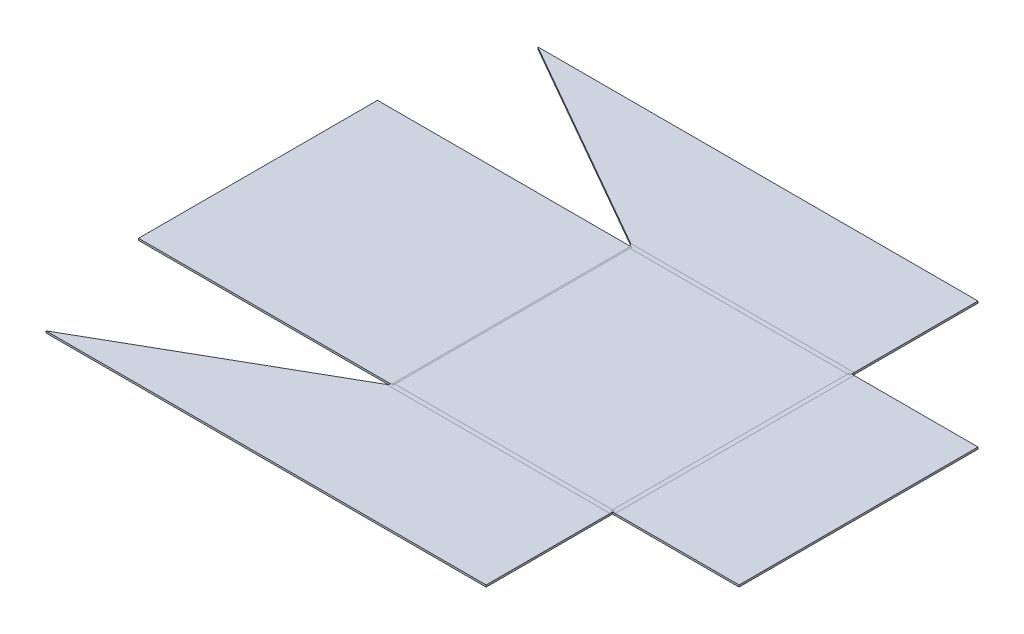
ISO-10303-21;
HEADER;
FILE_DESCRIPTION(('STEP AP214'),'2;1');
FILE_NAME('part.step','',(''),(''),'','','');
FILE_SCHEMA(('AUTOMOTIVE_DESIGN { 1 0 10303 214 1 1 1 1 }'));
ENDSEC;
DATA;
#1=APPLICATION_CONTEXT('core data for automotive mechanical design processes');
#2=APPLICATION_PROTOCOL_DEFINITION('international standard','automotive_design',2000,#1);
#3=PRODUCT_CONTEXT('',#1,'mechanical');
#4=PRODUCT('Part','Part','',(#3));
#5=PRODUCT_RELATED_PRODUCT_CATEGORY('part','',(#4));
#6=PRODUCT_DEFINITION_FORMATION('','',#4);
#7=PRODUCT_DEFINITION_CONTEXT('part definition',#1,'design');
#8=PRODUCT_DEFINITION('design','',#6,#7);
#9=PRODUCT_DEFINITION_SHAPE('','',#8);
#10=(LENGTH_UNIT() NAMED_UNIT(*) SI_UNIT(.MILLI.,.METRE.));
#11=(NAMED_UNIT(*) PLANE_ANGLE_UNIT() SI_UNIT($,.RADIAN.));
#12=(NAMED_UNIT(*) SI_UNIT($,.STERADIAN.) SOLID_ANGLE_UNIT());
#13=UNCERTAINTY_MEASURE_WITH_UNIT(LENGTH_MEASURE(1.E-05),#10,'distance_accuracy_value','');
#14=(GEOMETRIC_REPRESENTATION_CONTEXT(3) GLOBAL_UNCERTAINTY_ASSIGNED_CONTEXT((#13)) GLOBAL_UNIT_ASSIGNED_CONTEXT((#10,
#11,#12)) REPRESENTATION_CONTEXT('',''));
#15=CARTESIAN_POINT('',(0.,0.,0.));
#16=DIRECTION('',(0.,0.,1.));
#17=DIRECTION('',(1.,0.,0.));
#18=AXIS2_PLACEMENT_3D('',#15,#16,#17);
#19=CARTESIAN_POINT('',(350.,203.,190.));
#20=DIRECTION('',(0.,-1.,0.));
#21=DIRECTION('',(1.,0.,0.));
#22=AXIS2_PLACEMENT_3D('',#19,#20,#21);
#23=PLANE('',#22);
#24=DIRECTION('',(0.,0.,-1.));
#25=VECTOR('',#24,1.);
#26=CARTESIAN_POINT('',(0.796693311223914,203.,189.99));
#27=LINE('',#26,#25);
#28=CARTESIAN_POINT('',(0.796693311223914,203.,187.));
#29=VERTEX_POINT('',#28);
#30=CARTESIAN_POINT('',(0.796693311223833,203.,-187.));
#31=VERTEX_POINT('',#30);
#32=EDGE_CURVE('E1153',#29,#31,#27,.T.);
#33=ORIENTED_EDGE('',*,*,#32,.F.);
#34=DIRECTION('',(-1.,0.,0.));
#35=VECTOR('',#34,1.);
#36=CARTESIAN_POINT('',(349.99,203.,187.));
#37=LINE('',#36,#35);
#38=CARTESIAN_POINT('',(347.,203.,187.));
#39=VERTEX_POINT('',#38);
#40=EDGE_CURVE('E11',#39,#29,#37,.T.);
#41=ORIENTED_EDGE('',*,*,#40,.F.);
#42=DIRECTION('',(0.,0.,1.));
#43=VECTOR('',#42,1.);
#44=CARTESIAN_POINT('',(347.,203.,-189.99));
#45=LINE('',#44,#43);
#46=CARTESIAN_POINT('',(347.,203.,-187.));
#47=VERTEX_POINT('',#46);
#48=EDGE_CURVE('E1149',#47,#39,#45,.T.);
#49=ORIENTED_EDGE('',*,*,#48,.F.);
#50=DIRECTION('',(1.,0.,0.));
#51=VECTOR('',#50,1.);
#52=CARTESIAN_POINT('',(0.0201556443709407,203.,-187.));
#53=LINE('',#52,#51);
#54=EDGE_CURVE('E793',#31,#47,#53,.T.);
#55=ORIENTED_EDGE('',*,*,#54,.F.);
#56=EDGE_LOOP('',(#33,#41,#49,#55));
#57=FACE_BOUND('',#56,.T.);
#58=ADVANCED_FACE('F770',(#57),#23,.F.);
#59=CARTESIAN_POINT('',(351.068583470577,-653.022897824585,-189.99));
#60=DIRECTION('',(0.,0.,1.));
#61=DIRECTION('',(1.,0.,0.));
#62=AXIS2_PLACEMENT_3D('',#59,#60,#61);
#63=PLANE('',#62);
#64=DIRECTION('',(0.,1.,0.));
#65=VECTOR('',#64,1.);
#66=CARTESIAN_POINT('',(354.068583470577,-653.022897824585,-189.99));
#67=LINE('',#66,#65);
#68=CARTESIAN_POINT('',(354.068583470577,200.,-189.99));
#69=VERTEX_POINT('',#68);
#70=CARTESIAN_POINT('',(354.068583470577,203.,-189.99));
#71=VERTEX_POINT('',#70);
#72=EDGE_CURVE('E1141',#69,#71,#67,.T.);
#73=ORIENTED_EDGE('',*,*,#72,.T.);
#74=DIRECTION('',(1.,0.,0.));
#75=VECTOR('',#74,1.);
#76=CARTESIAN_POINT('',(348.068583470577,203.,-189.99));
#77=LINE('',#76,#75);
#78=CARTESIAN_POINT('',(551.068583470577,203.,-189.99));
#79=VERTEX_POINT('',#78);
#80=EDGE_CURVE('E1118',#71,#79,#77,.T.);
#81=ORIENTED_EDGE('',*,*,#80,.T.);
#82=DIRECTION('',(0.,1.,0.));
#83=VECTOR('',#82,1.);
#84=CARTESIAN_POINT('',(551.068583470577,-653.022897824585,-189.99));
#85=LINE('',#84,#83);
#86=CARTESIAN_POINT('',(551.068583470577,200.,-189.99));
#87=VERTEX_POINT('',#86);
#88=EDGE_CURVE('E1138',#87,#79,#85,.T.);
#89=ORIENTED_EDGE('',*,*,#88,.F.);
#90=DIRECTION('',(1.,0.,0.));
#91=VECTOR('',#90,1.);
#92=CARTESIAN_POINT('',(351.068583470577,200.,-189.99));
#93=LINE('',#92,#91);
#94=EDGE_CURVE('E1125',#69,#87,#93,.T.);
#95=ORIENTED_EDGE('',*,*,#94,.F.);
#96=EDGE_LOOP('',(#73,#81,#89,#95));
#97=FACE_BOUND('',#96,.T.);
#98=ADVANCED_FACE('F1376',(#97),#63,.F.);
#99=CARTESIAN_POINT('',(551.068583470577,-653.022897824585,190.));
#100=DIRECTION('',(1.,0.,0.));
#101=DIRECTION('',(0.,1.,0.));
#102=AXIS2_PLACEMENT_3D('',#99,#100,#101);
#103=PLANE('',#102);
#104=DIRECTION('',(0.,0.,-1.));
#105=VECTOR('',#104,1.);
#106=CARTESIAN_POINT('',(551.068583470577,203.,190.));
#107=LINE('',#106,#105);
#108=CARTESIAN_POINT('',(551.068583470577,203.,189.99));
#109=VERTEX_POINT('',#108);
#110=EDGE_CURVE('E1120',#109,#79,#107,.T.);
#111=ORIENTED_EDGE('',*,*,#110,.F.);
#112=DIRECTION('',(0.,1.,0.));
#113=VECTOR('',#112,1.);
#114=CARTESIAN_POINT('',(551.068583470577,-653.022897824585,189.99));
#115=LINE('',#114,#113);
#116=CARTESIAN_POINT('',(551.068583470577,200.,189.99));
#117=VERTEX_POINT('',#116);
#118=EDGE_CURVE('E1136',#117,#109,#115,.T.);
#119=ORIENTED_EDGE('',*,*,#118,.F.);
#120=DIRECTION('',(0.,0.,-1.));
#121=VECTOR('',#120,1.);
#122=CARTESIAN_POINT('',(551.068583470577,200.,190.));
#123=LINE('',#122,#121);
#124=EDGE_CURVE('E1127',#117,#87,#123,.T.);
#125=ORIENTED_EDGE('',*,*,#124,.T.);
#126=ORIENTED_EDGE('',*,*,#88,.T.);
#127=EDGE_LOOP('',(#111,#119,#125,#126));
#128=FACE_BOUND('',#127,.T.);
#129=ADVANCED_FACE('F1380',(#128),#103,.T.);
#130=CARTESIAN_POINT('',(351.068583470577,-653.022897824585,189.99));
#131=DIRECTION('',(0.,0.,1.));
#132=DIRECTION('',(1.,0.,0.));
#133=AXIS2_PLACEMENT_3D('',#130,#131,#132);
#134=PLANE('',#133);
#135=DIRECTION('',(1.,0.,0.));
#136=VECTOR('',#135,1.);
#137=CARTESIAN_POINT('',(351.068583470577,203.,189.99));
#138=LINE('',#137,#136);
#139=CARTESIAN_POINT('',(354.068583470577,203.,189.99));
#140=VERTEX_POINT('',#139);
#141=EDGE_CURVE('E1146',#140,#109,#138,.T.);
#142=ORIENTED_EDGE('',*,*,#141,.F.);
#143=DIRECTION('',(0.,1.,0.));
#144=VECTOR('',#143,1.);
#145=CARTESIAN_POINT('',(354.068583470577,-653.022897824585,189.99));
#146=LINE('',#145,#144);
#147=CARTESIAN_POINT('',(354.068583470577,200.,189.99));
#148=VERTEX_POINT('',#147);
#149=EDGE_CURVE('E1133',#148,#140,#146,.T.);
#150=ORIENTED_EDGE('',*,*,#149,.F.);
#151=DIRECTION('',(1.,0.,0.));
#152=VECTOR('',#151,1.);
#153=CARTESIAN_POINT('',(351.068583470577,200.,189.99));
#154=LINE('',#153,#152);
#155=EDGE_CURVE('E1143',#148,#117,#154,.T.);
#156=ORIENTED_EDGE('',*,*,#155,.T.);
#157=ORIENTED_EDGE('',*,*,#118,.T.);
#158=EDGE_LOOP('',(#142,#150,#156,#157));
#159=FACE_BOUND('',#158,.T.);
#160=ADVANCED_FACE('F1334',(#159),#134,.T.);
#161=CARTESIAN_POINT('',(551.068583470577,200.,190.));
#162=DIRECTION('',(0.,-1.,0.));
#163=DIRECTION('',(0.,0.,1.));
#164=AXIS2_PLACEMENT_3D('',#161,#162,#163);
#165=PLANE('',#164);
#166=DIRECTION('',(0.,0.,1.));
#167=VECTOR('',#166,1.);
#168=CARTESIAN_POINT('',(354.068583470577,200.,-189.99));
#169=LINE('',#168,#167);
#170=EDGE_CURVE('E1130',#69,#148,#169,.T.);
#171=ORIENTED_EDGE('',*,*,#170,.F.);
#172=ORIENTED_EDGE('',*,*,#94,.T.);
#173=ORIENTED_EDGE('',*,*,#124,.F.);
#174=ORIENTED_EDGE('',*,*,#155,.F.);
#175=EDGE_LOOP('',(#171,#172,#173,#174));
#176=FACE_BOUND('',#175,.T.);
#177=ADVANCED_FACE('F1388',(#176),#165,.T.);
#178=CARTESIAN_POINT('',(551.068583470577,203.,190.));
#179=DIRECTION('',(0.,-1.,0.));
#180=DIRECTION('',(0.,0.,1.));
#181=AXIS2_PLACEMENT_3D('',#178,#179,#180);
#182=PLANE('',#181);
#183=ORIENTED_EDGE('',*,*,#80,.F.);
#184=DIRECTION('',(0.,0.,1.));
#185=VECTOR('',#184,1.);
#186=CARTESIAN_POINT('',(354.068583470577,203.,-189.99));
#187=LINE('',#186,#185);
#188=EDGE_CURVE('E1123',#71,#140,#187,.T.);
#189=ORIENTED_EDGE('',*,*,#188,.T.);
#190=ORIENTED_EDGE('',*,*,#141,.T.);
#191=ORIENTED_EDGE('',*,*,#110,.T.);
#192=EDGE_LOOP('',(#183,#189,#190,#191));
#193=FACE_BOUND('',#192,.T.);
#194=ADVANCED_FACE('F1339',(#193),#182,.F.);
#195=CARTESIAN_POINT('',(-0.742770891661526,200.,190.));
#196=DIRECTION('',(0.,-1.,0.));
#197=DIRECTION('',(1.,0.,0.));
#198=AXIS2_PLACEMENT_3D('',#195,#196,#197);
#199=PLANE('',#198);
#200=DIRECTION('',(-1.,0.,0.));
#201=VECTOR('',#200,1.);
#202=CARTESIAN_POINT('',(-0.742770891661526,200.,189.99));
#203=LINE('',#202,#201);
#204=CARTESIAN_POINT('',(-1.53946420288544,200.,189.99));
#205=VERTEX_POINT('',#204);
#206=CARTESIAN_POINT('',(-2.20058632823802,200.,189.99));
#207=VERTEX_POINT('',#206);
#208=EDGE_CURVE('E1084',#205,#207,#203,.T.);
#209=ORIENTED_EDGE('',*,*,#208,.T.);
#210=DIRECTION('',(0.596254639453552,0.,-0.802795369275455));
#211=VECTOR('',#210,1.);
#212=CARTESIAN_POINT('',(-1.68709107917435,200.,189.298631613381));
#213=LINE('',#212,#211);
#214=CARTESIAN_POINT('',(-1.53946420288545,200.,189.099867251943));
#215=VERTEX_POINT('',#214);
#216=EDGE_CURVE('E1115',#207,#215,#213,.T.);
#217=ORIENTED_EDGE('',*,*,#216,.T.);
#218=DIRECTION('',(0.,0.,-1.));
#219=VECTOR('',#218,1.);
#220=CARTESIAN_POINT('',(-1.53946420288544,200.,189.99));
#221=LINE('',#220,#219);
#222=EDGE_CURVE('E1090',#205,#215,#221,.T.);
#223=ORIENTED_EDGE('',*,*,#222,.F.);
#224=EDGE_LOOP('',(#209,#217,#223));
#225=FACE_BOUND('',#224,.T.);
#226=ADVANCED_FACE('F1394',(#225),#199,.T.);
#227=DIRECTION('',(0.,0.,1.));
#228=VECTOR('',#227,1.);
#229=CARTESIAN_POINT('',(-1.53946420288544,200.,-189.99));
#230=LINE('',#229,#228);
#231=CARTESIAN_POINT('',(-1.53946420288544,200.,-189.99));
#232=VERTEX_POINT('',#231);
#233=CARTESIAN_POINT('',(-1.5394642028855,200.,-189.099867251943));
#234=VERTEX_POINT('',#233);
#235=EDGE_CURVE('E1278',#232,#234,#230,.T.);
#236=ORIENTED_EDGE('',*,*,#235,.T.);
#237=DIRECTION('',(-0.596254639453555,0.,-0.802795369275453));
#238=VECTOR('',#237,1.);
#239=CARTESIAN_POINT('',(180.207685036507,200.,55.6039222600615));
#240=LINE('',#239,#238);
#241=CARTESIAN_POINT('',(-2.20058632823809,200.,-189.99));
#242=VERTEX_POINT('',#241);
#243=EDGE_CURVE('E1112',#234,#242,#240,.T.);
#244=ORIENTED_EDGE('',*,*,#243,.T.);
#245=DIRECTION('',(-1.,0.,0.));
#246=VECTOR('',#245,1.);
#247=CARTESIAN_POINT('',(-0.742770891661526,200.,-189.99));
#248=LINE('',#247,#246);
#249=EDGE_CURVE('E1100',#232,#242,#248,.T.);
#250=ORIENTED_EDGE('',*,*,#249,.F.);
#251=EDGE_LOOP('',(#236,#244,#250));
#252=FACE_BOUND('',#251,.T.);
#253=ADVANCED_FACE('F1413',(#252),#199,.T.);
#254=CARTESIAN_POINT('',(-0.742770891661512,203.,190.));
#255=DIRECTION('',(0.,-1.,0.));
#256=DIRECTION('',(1.,0.,0.));
#257=AXIS2_PLACEMENT_3D('',#254,#255,#256);
#258=PLANE('',#257);
#259=DIRECTION('',(0.596254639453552,0.,-0.802795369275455));
#260=VECTOR('',#259,1.);
#261=CARTESIAN_POINT('',(-1.68709107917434,203.,189.298631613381));
#262=LINE('',#261,#260);
#263=CARTESIAN_POINT('',(-2.20058632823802,203.,189.99));
#264=VERTEX_POINT('',#263);
#265=CARTESIAN_POINT('',(-1.53946420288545,203.,189.099867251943));
#266=VERTEX_POINT('',#265);
#267=EDGE_CURVE('E1109',#264,#266,#262,.T.);
#268=ORIENTED_EDGE('',*,*,#267,.F.);
#269=DIRECTION('',(-1.,0.,0.));
#270=VECTOR('',#269,1.);
#271=CARTESIAN_POINT('',(0.0539224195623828,203.,189.99));
#272=LINE('',#271,#270);
#273=CARTESIAN_POINT('',(-1.53946420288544,203.,189.99));
#274=VERTEX_POINT('',#273);
#275=EDGE_CURVE('E1075',#274,#264,#272,.T.);
#276=ORIENTED_EDGE('',*,*,#275,.F.);
#277=DIRECTION('',(0.,0.,-1.));
#278=VECTOR('',#277,1.);
#279=CARTESIAN_POINT('',(-1.53946420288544,203.,189.99));
#280=LINE('',#279,#278);
#281=EDGE_CURVE('E1080',#274,#266,#280,.T.);
#282=ORIENTED_EDGE('',*,*,#281,.T.);
#283=EDGE_LOOP('',(#268,#276,#282));
#284=FACE_BOUND('',#283,.T.);
#285=ADVANCED_FACE('F1417',(#284),#258,.F.);
#286=DIRECTION('',(-0.596254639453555,0.,-0.802795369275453));
#287=VECTOR('',#286,1.);
#288=CARTESIAN_POINT('',(180.207685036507,203.,55.6039222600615));
#289=LINE('',#288,#287);
#290=CARTESIAN_POINT('',(-1.53946420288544,203.,-189.099867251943));
#291=VERTEX_POINT('',#290);
#292=CARTESIAN_POINT('',(-2.200586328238,203.,-189.99));
#293=VERTEX_POINT('',#292);
#294=EDGE_CURVE('E1106',#291,#293,#289,.T.);
#295=ORIENTED_EDGE('',*,*,#294,.F.);
#296=DIRECTION('',(0.,0.,1.));
#297=VECTOR('',#296,1.);
#298=CARTESIAN_POINT('',(-1.53946420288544,203.,-189.99));
#299=LINE('',#298,#297);
#300=CARTESIAN_POINT('',(-1.53946420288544,203.,-189.99));
#301=VERTEX_POINT('',#300);
#302=EDGE_CURVE('E1269',#301,#291,#299,.T.);
#303=ORIENTED_EDGE('',*,*,#302,.F.);
#304=DIRECTION('',(-1.,0.,0.));
#305=VECTOR('',#304,1.);
#306=CARTESIAN_POINT('',(-0.742770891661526,203.,-189.99));
#307=LINE('',#306,#305);
#308=EDGE_CURVE('E1103',#301,#293,#307,.T.);
#309=ORIENTED_EDGE('',*,*,#308,.T.);
#310=EDGE_LOOP('',(#295,#303,#309));
#311=FACE_BOUND('',#310,.T.);
#312=ADVANCED_FACE('F1399',(#311),#258,.F.);
#313=CARTESIAN_POINT('',(-0.742770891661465,-903.784749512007,189.99));
#314=DIRECTION('',(0.,0.,-1.));
#315=DIRECTION('',(-1.,0.,0.));
#316=AXIS2_PLACEMENT_3D('',#313,#314,#315);
#317=PLANE('',#316);
#318=CARTESIAN_POINT('',(-403.855658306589,200.,189.99));
#319=VERTEX_POINT('',#318);
#320=EDGE_CURVE('E1083',#207,#319,#203,.T.);
#321=ORIENTED_EDGE('',*,*,#320,.F.);
#322=DIRECTION('',(0.,1.,0.));
#323=VECTOR('',#322,1.);
#324=CARTESIAN_POINT('',(-2.20058632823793,-903.784749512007,189.99));
#325=LINE('',#324,#323);
#326=EDGE_CURVE('E1071',#207,#264,#325,.T.);
#327=ORIENTED_EDGE('',*,*,#326,.T.);
#328=CARTESIAN_POINT('',(-403.855658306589,203.,189.99));
#329=VERTEX_POINT('',#328);
#330=EDGE_CURVE('E1074',#264,#329,#272,.T.);
#331=ORIENTED_EDGE('',*,*,#330,.T.);
#332=DIRECTION('',(0.,1.,0.));
#333=VECTOR('',#332,1.);
#334=CARTESIAN_POINT('',(-403.855658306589,-903.784749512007,189.99));
#335=LINE('',#334,#333);
#336=EDGE_CURVE('E1096',#319,#329,#335,.T.);
#337=ORIENTED_EDGE('',*,*,#336,.F.);
#338=EDGE_LOOP('',(#321,#327,#331,#337));
#339=FACE_BOUND('',#338,.T.);
#340=ADVANCED_FACE('F1395',(#339),#317,.F.);
#341=CARTESIAN_POINT('',(-403.855658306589,-903.784749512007,190.));
#342=DIRECTION('',(1.,0.,0.));
#343=DIRECTION('',(0.,1.,0.));
#344=AXIS2_PLACEMENT_3D('',#341,#342,#343);
#345=PLANE('',#344);
#346=ORIENTED_EDGE('',*,*,#336,.T.);
#347=DIRECTION('',(0.,0.,-1.));
#348=VECTOR('',#347,1.);
#349=CARTESIAN_POINT('',(-403.855658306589,203.,190.));
#350=LINE('',#349,#348);
#351=CARTESIAN_POINT('',(-403.855658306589,203.,-189.99));
#352=VERTEX_POINT('',#351);
#353=EDGE_CURVE('E1077',#329,#352,#350,.T.);
#354=ORIENTED_EDGE('',*,*,#353,.T.);
#355=DIRECTION('',(0.,1.,0.));
#356=VECTOR('',#355,1.);
#357=CARTESIAN_POINT('',(-403.855658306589,-903.784749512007,-189.99));
#358=LINE('',#357,#356);
#359=CARTESIAN_POINT('',(-403.855658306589,200.,-189.99));
#360=VERTEX_POINT('',#359);
#361=EDGE_CURVE('E1093',#360,#352,#358,.T.);
#362=ORIENTED_EDGE('',*,*,#361,.F.);
#363=DIRECTION('',(0.,0.,-1.));
#364=VECTOR('',#363,1.);
#365=CARTESIAN_POINT('',(-403.855658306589,200.,190.));
#366=LINE('',#365,#364);
#367=EDGE_CURVE('E1087',#319,#360,#366,.T.);
#368=ORIENTED_EDGE('',*,*,#367,.F.);
#369=EDGE_LOOP('',(#346,#354,#362,#368));
#370=FACE_BOUND('',#369,.T.);
#371=ADVANCED_FACE('F1398',(#370),#345,.F.);
#372=CARTESIAN_POINT('',(-0.742770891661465,-903.784749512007,-189.99));
#373=DIRECTION('',(0.,0.,-1.));
#374=DIRECTION('',(-1.,0.,0.));
#375=AXIS2_PLACEMENT_3D('',#372,#373,#374);
#376=PLANE('',#375);
#377=DIRECTION('',(0.,1.,0.));
#378=VECTOR('',#377,1.);
#379=CARTESIAN_POINT('',(-2.20058632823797,-903.784749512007,-189.99));
#380=LINE('',#379,#378);
#381=EDGE_CURVE('E1069',#242,#293,#380,.T.);
#382=ORIENTED_EDGE('',*,*,#381,.F.);
#383=EDGE_CURVE('E1099',#242,#360,#248,.T.);
#384=ORIENTED_EDGE('',*,*,#383,.T.);
#385=ORIENTED_EDGE('',*,*,#361,.T.);
#386=EDGE_CURVE('E1102',#293,#352,#307,.T.);
#387=ORIENTED_EDGE('',*,*,#386,.F.);
#388=EDGE_LOOP('',(#382,#384,#385,#387));
#389=FACE_BOUND('',#388,.T.);
#390=ADVANCED_FACE('F1403',(#389),#376,.T.);
#391=ORIENTED_EDGE('',*,*,#216,.F.);
#392=ORIENTED_EDGE('',*,*,#320,.T.);
#393=ORIENTED_EDGE('',*,*,#367,.T.);
#394=ORIENTED_EDGE('',*,*,#383,.F.);
#395=ORIENTED_EDGE('',*,*,#243,.F.);
#396=EDGE_CURVE('E1277',#234,#215,#230,.T.);
#397=ORIENTED_EDGE('',*,*,#396,.T.);
#398=EDGE_LOOP('',(#391,#392,#393,#394,#395,#397));
#399=FACE_BOUND('',#398,.T.);
#400=ADVANCED_FACE('F1407',(#399),#199,.T.);
#401=ORIENTED_EDGE('',*,*,#330,.F.);
#402=ORIENTED_EDGE('',*,*,#267,.T.);
#403=EDGE_CURVE('E1268',#291,#266,#299,.T.);
#404=ORIENTED_EDGE('',*,*,#403,.F.);
#405=ORIENTED_EDGE('',*,*,#294,.T.);
#406=ORIENTED_EDGE('',*,*,#386,.T.);
#407=ORIENTED_EDGE('',*,*,#353,.F.);
#408=EDGE_LOOP('',(#401,#402,#404,#405,#406,#407));
#409=FACE_BOUND('',#408,.T.);
#410=ADVANCED_FACE('F1411',(#409),#258,.F.);
#411=CARTESIAN_POINT('',(349.99,200.,194.068583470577));
#412=DIRECTION('',(0.,-1.,0.));
#413=DIRECTION('',(1.,0.,0.));
#414=AXIS2_PLACEMENT_3D('',#411,#412,#413);
#415=PLANE('',#414);
#416=ORIENTED_EDGE('',*,*,#208,.F.);
#417=DIRECTION('',(1.,0.,0.));
#418=VECTOR('',#417,1.);
#419=CARTESIAN_POINT('',(-1.53946420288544,200.,189.99));
#420=LINE('',#419,#418);
#421=CARTESIAN_POINT('',(0.796693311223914,200.,189.99));
#422=VERTEX_POINT('',#421);
#423=EDGE_CURVE('E1271',#205,#422,#420,.T.);
#424=ORIENTED_EDGE('',*,*,#423,.T.);
#425=DIRECTION('',(0.,0.,-1.));
#426=VECTOR('',#425,1.);
#427=CARTESIAN_POINT('',(0.796693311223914,200.,189.99));
#428=LINE('',#427,#426);
#429=CARTESIAN_POINT('',(0.796693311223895,200.,187.));
#430=VERTEX_POINT('',#429);
#431=EDGE_CURVE('E1171',#422,#430,#428,.T.);
#432=ORIENTED_EDGE('',*,*,#431,.T.);
#433=DIRECTION('',(-1.,0.,0.));
#434=VECTOR('',#433,1.);
#435=CARTESIAN_POINT('',(349.99,200.,187.));
#436=LINE('',#435,#434);
#437=CARTESIAN_POINT('',(347.,200.,187.));
#438=VERTEX_POINT('',#437);
#439=EDGE_CURVE('E778',#438,#430,#436,.T.);
#440=ORIENTED_EDGE('',*,*,#439,.F.);
#441=DIRECTION('',(0.,0.,1.));
#442=VECTOR('',#441,1.);
#443=CARTESIAN_POINT('',(347.,200.,-189.99));
#444=LINE('',#443,#442);
#445=CARTESIAN_POINT('',(347.,200.,189.99));
#446=VERTEX_POINT('',#445);
#447=EDGE_CURVE('E1168',#438,#446,#444,.T.);
#448=ORIENTED_EDGE('',*,*,#447,.T.);
#449=DIRECTION('',(1.,0.,0.));
#450=VECTOR('',#449,1.);
#451=CARTESIAN_POINT('',(347.,200.,189.99));
#452=LINE('',#451,#450);
#453=CARTESIAN_POINT('',(349.99,200.,189.99));
#454=VERTEX_POINT('',#453);
#455=EDGE_CURVE('E1184',#446,#454,#452,.T.);
#456=ORIENTED_EDGE('',*,*,#455,.T.);
#457=DIRECTION('',(0.,0.,-1.));
#458=VECTOR('',#457,1.);
#459=CARTESIAN_POINT('',(349.99,200.,194.068583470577));
#460=LINE('',#459,#458);
#461=CARTESIAN_POINT('',(349.99,200.,194.068583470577));
#462=VERTEX_POINT('',#461);
#463=EDGE_CURVE('E1253',#462,#454,#460,.T.);
#464=ORIENTED_EDGE('',*,*,#463,.F.);
#465=DIRECTION('',(-1.,0.,0.));
#466=VECTOR('',#465,1.);
#467=CARTESIAN_POINT('',(349.99,200.,194.068583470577));
#468=LINE('',#467,#466);
#469=CARTESIAN_POINT('',(-5.22984435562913,200.,194.068583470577));
#470=VERTEX_POINT('',#469);
#471=EDGE_CURVE('E1050',#462,#470,#468,.T.);
#472=ORIENTED_EDGE('',*,*,#471,.T.);
#473=DIRECTION('',(-0.596254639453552,0.,0.802795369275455));
#474=VECTOR('',#473,1.);
#475=CARTESIAN_POINT('',(0.0201556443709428,200.,187.));
#476=LINE('',#475,#474);
#477=EDGE_CURVE('E1256',#207,#470,#476,.T.);
#478=ORIENTED_EDGE('',*,*,#477,.F.);
#479=EDGE_LOOP('',(#416,#424,#432,#440,#448,#456,#464,#472,#478));
#480=FACE_BOUND('',#479,.T.);
#481=ADVANCED_FACE('F1166',(#480),#415,.T.);
#482=CARTESIAN_POINT('',(349.99,203.,194.068583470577));
#483=DIRECTION('',(0.,-1.,0.));
#484=DIRECTION('',(1.,0.,0.));
#485=AXIS2_PLACEMENT_3D('',#482,#483,#484);
#486=PLANE('',#485);
#487=DIRECTION('',(1.,0.,0.));
#488=VECTOR('',#487,1.);
#489=CARTESIAN_POINT('',(-1.53946420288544,203.,189.99));
#490=LINE('',#489,#488);
#491=CARTESIAN_POINT('',(0.796693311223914,203.,189.99));
#492=VERTEX_POINT('',#491);
#493=EDGE_CURVE('E1258',#274,#492,#490,.T.);
#494=ORIENTED_EDGE('',*,*,#493,.F.);
#495=ORIENTED_EDGE('',*,*,#275,.T.);
#496=DIRECTION('',(-0.596254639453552,0.,0.802795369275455));
#497=VECTOR('',#496,1.);
#498=CARTESIAN_POINT('',(0.0201556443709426,203.,187.));
#499=LINE('',#498,#497);
#500=CARTESIAN_POINT('',(-5.22984435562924,203.,194.068583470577));
#501=VERTEX_POINT('',#500);
#502=EDGE_CURVE('E1251',#264,#501,#499,.T.);
#503=ORIENTED_EDGE('',*,*,#502,.T.);
#504=DIRECTION('',(-1.,0.,0.));
#505=VECTOR('',#504,1.);
#506=CARTESIAN_POINT('',(349.99,203.,194.068583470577));
#507=LINE('',#506,#505);
#508=CARTESIAN_POINT('',(349.99,203.,194.068583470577));
#509=VERTEX_POINT('',#508);
#510=EDGE_CURVE('E1042',#509,#501,#507,.T.);
#511=ORIENTED_EDGE('',*,*,#510,.F.);
#512=DIRECTION('',(0.,0.,-1.));
#513=VECTOR('',#512,1.);
#514=CARTESIAN_POINT('',(349.99,203.,194.068583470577));
#515=LINE('',#514,#513);
#516=CARTESIAN_POINT('',(349.99,203.,189.99));
#517=VERTEX_POINT('',#516);
#518=EDGE_CURVE('E1248',#509,#517,#515,.T.);
#519=ORIENTED_EDGE('',*,*,#518,.T.);
#520=DIRECTION('',(1.,0.,0.));
#521=VECTOR('',#520,1.);
#522=CARTESIAN_POINT('',(347.,203.,189.99));
#523=LINE('',#522,#521);
#524=CARTESIAN_POINT('',(347.,203.,189.99));
#525=VERTEX_POINT('',#524);
#526=EDGE_CURVE('E1314',#525,#517,#523,.T.);
#527=ORIENTED_EDGE('',*,*,#526,.F.);
#528=DIRECTION('',(0.,0.,1.));
#529=VECTOR('',#528,1.);
#530=CARTESIAN_POINT('',(347.,203.,-189.99));
#531=LINE('',#530,#529);
#532=EDGE_CURVE('E1309',#39,#525,#531,.T.);
#533=ORIENTED_EDGE('',*,*,#532,.F.);
#534=ORIENTED_EDGE('',*,*,#40,.T.);
#535=DIRECTION('',(0.,0.,-1.));
#536=VECTOR('',#535,1.);
#537=CARTESIAN_POINT('',(0.796693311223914,203.,189.99));
#538=LINE('',#537,#536);
#539=EDGE_CURVE('E1262',#492,#29,#538,.T.);
#540=ORIENTED_EDGE('',*,*,#539,.F.);
#541=EDGE_LOOP('',(#494,#495,#503,#511,#519,#527,#533,#534,#540));
#542=FACE_BOUND('',#541,.T.);
#543=ADVANCED_FACE('F1360',(#542),#486,.F.);
#544=CARTESIAN_POINT('',(0.0201556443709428,200.,187.));
#545=DIRECTION('',(-0.802795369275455,0.,-0.596254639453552));
#546=DIRECTION('',(-0.596254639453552,0.,0.802795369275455));
#547=AXIS2_PLACEMENT_3D('',#544,#545,#546);
#548=PLANE('',#547);
#549=ORIENTED_EDGE('',*,*,#326,.F.);
#550=ORIENTED_EDGE('',*,*,#477,.T.);
#551=DIRECTION('',(0.,1.,0.));
#552=VECTOR('',#551,1.);
#553=CARTESIAN_POINT('',(-5.22984435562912,-1251.32703750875,194.068583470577));
#554=LINE('',#553,#552);
#555=EDGE_CURVE('E1053',#470,#501,#554,.T.);
#556=ORIENTED_EDGE('',*,*,#555,.T.);
#557=ORIENTED_EDGE('',*,*,#502,.F.);
#558=EDGE_LOOP('',(#549,#550,#556,#557));
#559=FACE_BOUND('',#558,.T.);
#560=ADVANCED_FACE('F1422',(#559),#548,.T.);
#561=CARTESIAN_POINT('',(349.99,-1251.32703750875,191.068583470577));
#562=DIRECTION('',(-1.,0.,0.));
#563=DIRECTION('',(0.,0.,1.));
#564=AXIS2_PLACEMENT_3D('',#561,#562,#563);
#565=PLANE('',#564);
#566=DIRECTION('',(0.,1.,0.));
#567=VECTOR('',#566,1.);
#568=CARTESIAN_POINT('',(349.99,-1251.32703750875,194.068583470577));
#569=LINE('',#568,#567);
#570=EDGE_CURVE('E1061',#462,#509,#569,.T.);
#571=ORIENTED_EDGE('',*,*,#570,.T.);
#572=DIRECTION('',(0.,0.,1.));
#573=VECTOR('',#572,1.);
#574=CARTESIAN_POINT('',(349.99,203.,188.068583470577));
#575=LINE('',#574,#573);
#576=CARTESIAN_POINT('',(349.99,203.,391.068583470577));
#577=VERTEX_POINT('',#576);
#578=EDGE_CURVE('E1031',#509,#577,#575,.T.);
#579=ORIENTED_EDGE('',*,*,#578,.T.);
#580=DIRECTION('',(0.,1.,0.));
#581=VECTOR('',#580,1.);
#582=CARTESIAN_POINT('',(349.99,-1251.32703750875,391.068583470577));
#583=LINE('',#582,#581);
#584=CARTESIAN_POINT('',(349.99,200.,391.068583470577));
#585=VERTEX_POINT('',#584);
#586=EDGE_CURVE('E1058',#585,#577,#583,.T.);
#587=ORIENTED_EDGE('',*,*,#586,.F.);
#588=DIRECTION('',(0.,0.,1.));
#589=VECTOR('',#588,1.);
#590=CARTESIAN_POINT('',(349.99,200.,191.068583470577));
#591=LINE('',#590,#589);
#592=EDGE_CURVE('E1045',#462,#585,#591,.T.);
#593=ORIENTED_EDGE('',*,*,#592,.F.);
#594=EDGE_LOOP('',(#571,#579,#587,#593));
#595=FACE_BOUND('',#594,.T.);
#596=ADVANCED_FACE('F1418',(#595),#565,.F.);
#597=CARTESIAN_POINT('',(-350.,-1251.32703750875,391.068583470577));
#598=DIRECTION('',(0.,0.,1.));
#599=DIRECTION('',(1.,0.,0.));
#600=AXIS2_PLACEMENT_3D('',#597,#598,#599);
#601=PLANE('',#600);
#602=DIRECTION('',(1.,0.,0.));
#603=VECTOR('',#602,1.);
#604=CARTESIAN_POINT('',(350.,203.,391.068583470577));
#605=LINE('',#604,#603);
#606=CARTESIAN_POINT('',(-349.979844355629,203.,391.068583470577));
#607=VERTEX_POINT('',#606);
#608=EDGE_CURVE('E1034',#607,#577,#605,.T.);
#609=ORIENTED_EDGE('',*,*,#608,.F.);
#610=DIRECTION('',(0.,1.,0.));
#611=VECTOR('',#610,1.);
#612=CARTESIAN_POINT('',(-349.979844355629,-1251.32703750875,391.068583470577));
#613=LINE('',#612,#611);
#614=CARTESIAN_POINT('',(-349.979844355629,200.,391.068583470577));
#615=VERTEX_POINT('',#614);
#616=EDGE_CURVE('E1056',#615,#607,#613,.T.);
#617=ORIENTED_EDGE('',*,*,#616,.F.);
#618=DIRECTION('',(1.,0.,0.));
#619=VECTOR('',#618,1.);
#620=CARTESIAN_POINT('',(-350.,200.,391.068583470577));
#621=LINE('',#620,#619);
#622=EDGE_CURVE('E1047',#615,#585,#621,.T.);
#623=ORIENTED_EDGE('',*,*,#622,.T.);
#624=ORIENTED_EDGE('',*,*,#586,.T.);
#625=EDGE_LOOP('',(#609,#617,#623,#624));
#626=FACE_BOUND('',#625,.T.);
#627=ADVANCED_FACE('F1421',(#626),#601,.T.);
#628=CARTESIAN_POINT('',(0.0201556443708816,-1251.32703750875,191.068583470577));
#629=DIRECTION('',(-0.496138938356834,0.,-0.868243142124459));
#630=DIRECTION('',(-0.868243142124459,0.,0.496138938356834));
#631=AXIS2_PLACEMENT_3D('',#628,#629,#630);
#632=PLANE('',#631);
#633=DIRECTION('',(-0.868243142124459,0.,0.496138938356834));
#634=VECTOR('',#633,1.);
#635=CARTESIAN_POINT('',(0.0201556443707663,203.,191.068583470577));
#636=LINE('',#635,#634);
#637=EDGE_CURVE('E1066',#501,#607,#636,.T.);
#638=ORIENTED_EDGE('',*,*,#637,.F.);
#639=ORIENTED_EDGE('',*,*,#555,.F.);
#640=DIRECTION('',(-0.868243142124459,0.,0.496138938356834));
#641=VECTOR('',#640,1.);
#642=CARTESIAN_POINT('',(0.0201556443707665,200.,191.068583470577));
#643=LINE('',#642,#641);
#644=EDGE_CURVE('E1063',#470,#615,#643,.T.);
#645=ORIENTED_EDGE('',*,*,#644,.T.);
#646=ORIENTED_EDGE('',*,*,#616,.T.);
#647=EDGE_LOOP('',(#638,#639,#645,#646));
#648=FACE_BOUND('',#647,.T.);
#649=ADVANCED_FACE('F1426',(#648),#632,.T.);
#650=CARTESIAN_POINT('',(350.,200.,-8.93141652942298));
#651=DIRECTION('',(0.,-1.,0.));
#652=DIRECTION('',(-1.,0.,0.));
#653=AXIS2_PLACEMENT_3D('',#650,#651,#652);
#654=PLANE('',#653);
#655=ORIENTED_EDGE('',*,*,#471,.F.);
#656=ORIENTED_EDGE('',*,*,#592,.T.);
#657=ORIENTED_EDGE('',*,*,#622,.F.);
#658=ORIENTED_EDGE('',*,*,#644,.F.);
#659=EDGE_LOOP('',(#655,#656,#657,#658));
#660=FACE_BOUND('',#659,.T.);
#661=ADVANCED_FACE('F1430',(#660),#654,.T.);
#662=CARTESIAN_POINT('',(350.,203.,-8.93141652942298));
#663=DIRECTION('',(0.,-1.,0.));
#664=DIRECTION('',(-1.,0.,0.));
#665=AXIS2_PLACEMENT_3D('',#662,#663,#664);
#666=PLANE('',#665);
#667=ORIENTED_EDGE('',*,*,#578,.F.);
#668=ORIENTED_EDGE('',*,*,#510,.T.);
#669=ORIENTED_EDGE('',*,*,#637,.T.);
#670=ORIENTED_EDGE('',*,*,#608,.T.);
#671=EDGE_LOOP('',(#667,#668,#669,#670));
#672=FACE_BOUND('',#671,.T.);
#673=ADVANCED_FACE('F1434',(#672),#666,.F.);
#674=CARTESIAN_POINT('',(0.020155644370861,-1251.32703750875,-191.068583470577));
#675=DIRECTION('',(0.496138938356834,0.,-0.868243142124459));
#676=DIRECTION('',(-0.868243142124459,0.,-0.496138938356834));
#677=AXIS2_PLACEMENT_3D('',#674,#675,#676);
#678=PLANE('',#677);
#679=DIRECTION('',(-0.868243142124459,0.,-0.496138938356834));
#680=VECTOR('',#679,1.);
#681=CARTESIAN_POINT('',(5.27015564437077,203.,-188.068583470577));
#682=LINE('',#681,#680);
#683=CARTESIAN_POINT('',(-5.22984435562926,203.,-194.068583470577));
#684=VERTEX_POINT('',#683);
#685=CARTESIAN_POINT('',(-349.979844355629,203.,-391.068583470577));
#686=VERTEX_POINT('',#685);
#687=EDGE_CURVE('E1024',#684,#686,#682,.T.);
#688=ORIENTED_EDGE('',*,*,#687,.T.);
#689=DIRECTION('',(0.,1.,0.));
#690=VECTOR('',#689,1.);
#691=CARTESIAN_POINT('',(-349.979844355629,-1251.32703750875,-391.068583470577));
#692=LINE('',#691,#690);
#693=CARTESIAN_POINT('',(-349.979844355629,200.,-391.068583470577));
#694=VERTEX_POINT('',#693);
#695=EDGE_CURVE('E1233',#694,#686,#692,.T.);
#696=ORIENTED_EDGE('',*,*,#695,.F.);
#697=DIRECTION('',(-0.868243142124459,0.,-0.496138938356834));
#698=VECTOR('',#697,1.);
#699=CARTESIAN_POINT('',(0.0201556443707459,200.,-191.068583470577));
#700=LINE('',#699,#698);
#701=CARTESIAN_POINT('',(-5.22984435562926,200.,-194.068583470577));
#702=VERTEX_POINT('',#701);
#703=EDGE_CURVE('E1026',#702,#694,#700,.T.);
#704=ORIENTED_EDGE('',*,*,#703,.F.);
#705=DIRECTION('',(0.,1.,0.));
#706=VECTOR('',#705,1.);
#707=CARTESIAN_POINT('',(-5.22984435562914,-1251.32703750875,-194.068583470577));
#708=LINE('',#707,#706);
#709=EDGE_CURVE('E1036',#702,#684,#708,.T.);
#710=ORIENTED_EDGE('',*,*,#709,.T.);
#711=EDGE_LOOP('',(#688,#696,#704,#710));
#712=FACE_BOUND('',#711,.T.);
#713=ADVANCED_FACE('F1238',(#712),#678,.F.);
#714=CARTESIAN_POINT('',(-350.,-1251.32703750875,-391.068583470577));
#715=DIRECTION('',(0.,0.,1.));
#716=DIRECTION('',(1.,0.,0.));
#717=AXIS2_PLACEMENT_3D('',#714,#715,#716);
#718=PLANE('',#717);
#719=DIRECTION('',(1.,0.,0.));
#720=VECTOR('',#719,1.);
#721=CARTESIAN_POINT('',(350.,203.,-391.068583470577));
#722=LINE('',#721,#720);
#723=CARTESIAN_POINT('',(349.99,203.,-391.068583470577));
#724=VERTEX_POINT('',#723);
#725=EDGE_CURVE('E1222',#686,#724,#722,.T.);
#726=ORIENTED_EDGE('',*,*,#725,.T.);
#727=DIRECTION('',(0.,1.,0.));
#728=VECTOR('',#727,1.);
#729=CARTESIAN_POINT('',(349.99,-1251.32703750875,-391.068583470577));
#730=LINE('',#729,#728);
#731=CARTESIAN_POINT('',(349.99,200.,-391.068583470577));
#732=VERTEX_POINT('',#731);
#733=EDGE_CURVE('E1016',#732,#724,#730,.T.);
#734=ORIENTED_EDGE('',*,*,#733,.F.);
#735=DIRECTION('',(1.,0.,0.));
#736=VECTOR('',#735,1.);
#737=CARTESIAN_POINT('',(-350.,200.,-391.068583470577));
#738=LINE('',#737,#736);
#739=EDGE_CURVE('E1227',#694,#732,#738,.T.);
#740=ORIENTED_EDGE('',*,*,#739,.F.);
#741=ORIENTED_EDGE('',*,*,#695,.T.);
#742=EDGE_LOOP('',(#726,#734,#740,#741));
#743=FACE_BOUND('',#742,.T.);
#744=ADVANCED_FACE('F1441',(#743),#718,.F.);
#745=CARTESIAN_POINT('',(349.99,-1251.32703750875,-191.068583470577));
#746=DIRECTION('',(1.,0.,0.));
#747=DIRECTION('',(0.,0.,-1.));
#748=AXIS2_PLACEMENT_3D('',#745,#746,#747);
#749=PLANE('',#748);
#750=ORIENTED_EDGE('',*,*,#733,.T.);
#751=DIRECTION('',(0.,0.,1.));
#752=VECTOR('',#751,1.);
#753=CARTESIAN_POINT('',(349.99,203.,-191.068583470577));
#754=LINE('',#753,#752);
#755=CARTESIAN_POINT('',(349.99,203.,-194.068583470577));
#756=VERTEX_POINT('',#755);
#757=EDGE_CURVE('E1021',#724,#756,#754,.T.);
#758=ORIENTED_EDGE('',*,*,#757,.T.);
#759=DIRECTION('',(0.,1.,0.));
#760=VECTOR('',#759,1.);
#761=CARTESIAN_POINT('',(349.99,-1251.32703750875,-194.068583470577));
#762=LINE('',#761,#760);
#763=CARTESIAN_POINT('',(349.99,200.,-194.068583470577));
#764=VERTEX_POINT('',#763);
#765=EDGE_CURVE('E1008',#764,#756,#762,.T.);
#766=ORIENTED_EDGE('',*,*,#765,.F.);
#767=DIRECTION('',(0.,0.,1.));
#768=VECTOR('',#767,1.);
#769=CARTESIAN_POINT('',(349.99,200.,-191.068583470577));
#770=LINE('',#769,#768);
#771=EDGE_CURVE('E1032',#732,#764,#770,.T.);
#772=ORIENTED_EDGE('',*,*,#771,.F.);
#773=EDGE_LOOP('',(#750,#758,#766,#772));
#774=FACE_BOUND('',#773,.T.);
#775=ADVANCED_FACE('F1029',(#774),#749,.T.);
#776=CARTESIAN_POINT('',(350.,200.,8.93141652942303));
#777=DIRECTION('',(0.,1.,0.));
#778=DIRECTION('',(-1.,0.,0.));
#779=AXIS2_PLACEMENT_3D('',#776,#777,#778);
#780=PLANE('',#779);
#781=ORIENTED_EDGE('',*,*,#771,.T.);
#782=DIRECTION('',(-1.,0.,0.));
#783=VECTOR('',#782,1.);
#784=CARTESIAN_POINT('',(-5.22984435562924,200.,-194.068583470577));
#785=LINE('',#784,#783);
#786=EDGE_CURVE('E1017',#764,#702,#785,.T.);
#787=ORIENTED_EDGE('',*,*,#786,.T.);
#788=ORIENTED_EDGE('',*,*,#703,.T.);
#789=ORIENTED_EDGE('',*,*,#739,.T.);
#790=EDGE_LOOP('',(#781,#787,#788,#789));
#791=FACE_BOUND('',#790,.T.);
#792=ADVANCED_FACE('F1447',(#791),#780,.F.);
#793=CARTESIAN_POINT('',(350.,203.,8.93141652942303));
#794=DIRECTION('',(0.,1.,0.));
#795=DIRECTION('',(-1.,0.,0.));
#796=AXIS2_PLACEMENT_3D('',#793,#794,#795);
#797=PLANE('',#796);
#798=DIRECTION('',(-1.,0.,0.));
#799=VECTOR('',#798,1.);
#800=CARTESIAN_POINT('',(-5.22984435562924,203.,-194.068583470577));
#801=LINE('',#800,#799);
#802=EDGE_CURVE('E998',#756,#684,#801,.T.);
#803=ORIENTED_EDGE('',*,*,#802,.F.);
#804=ORIENTED_EDGE('',*,*,#757,.F.);
#805=ORIENTED_EDGE('',*,*,#725,.F.);
#806=ORIENTED_EDGE('',*,*,#687,.F.);
#807=EDGE_LOOP('',(#803,#804,#805,#806));
#808=FACE_BOUND('',#807,.T.);
#809=ADVANCED_FACE('F1020',(#808),#797,.T.);
#810=CARTESIAN_POINT('',(347.,200.,-189.99));
#811=DIRECTION('',(0.,1.,0.));
#812=DIRECTION('',(0.,0.,1.));
#813=AXIS2_PLACEMENT_3D('',#810,#811,#812);
#814=PLANE('',#813);
#815=DIRECTION('',(0.,0.,-1.));
#816=VECTOR('',#815,1.);
#817=CARTESIAN_POINT('',(349.99,200.,-189.99));
#818=LINE('',#817,#816);
#819=CARTESIAN_POINT('',(349.99,200.,187.));
#820=VERTEX_POINT('',#819);
#821=EDGE_CURVE('E1178',#454,#820,#818,.T.);
#822=ORIENTED_EDGE('',*,*,#821,.F.);
#823=ORIENTED_EDGE('',*,*,#455,.F.);
#824=ORIENTED_EDGE('',*,*,#447,.F.);
#825=DIRECTION('',(-1.,0.,0.));
#826=VECTOR('',#825,1.);
#827=CARTESIAN_POINT('',(347.,200.,187.));
#828=LINE('',#827,#826);
#829=EDGE_CURVE('E1174',#820,#438,#828,.T.);
#830=ORIENTED_EDGE('',*,*,#829,.F.);
#831=EDGE_LOOP('',(#822,#823,#824,#830));
#832=FACE_BOUND('',#831,.T.);
#833=ADVANCED_FACE('F1183',(#832),#814,.F.);
#834=DIRECTION('',(0.,0.,-1.));
#835=VECTOR('',#834,1.);
#836=CARTESIAN_POINT('',(349.99,200.,-189.99));
#837=LINE('',#836,#835);
#838=CARTESIAN_POINT('',(349.99,200.,-187.));
#839=VERTEX_POINT('',#838);
#840=CARTESIAN_POINT('',(349.99,200.,-189.99));
#841=VERTEX_POINT('',#840);
#842=EDGE_CURVE('E1181',#839,#841,#837,.T.);
#843=ORIENTED_EDGE('',*,*,#842,.F.);
#844=DIRECTION('',(1.,0.,0.));
#845=VECTOR('',#844,1.);
#846=CARTESIAN_POINT('',(347.,200.,-187.));
#847=LINE('',#846,#845);
#848=CARTESIAN_POINT('',(347.,200.,-187.));
#849=VERTEX_POINT('',#848);
#850=EDGE_CURVE('E1214',#849,#839,#847,.T.);
#851=ORIENTED_EDGE('',*,*,#850,.F.);
#852=CARTESIAN_POINT('',(347.,200.,-189.99));
#853=VERTEX_POINT('',#852);
#854=EDGE_CURVE('E1186',#853,#849,#444,.T.);
#855=ORIENTED_EDGE('',*,*,#854,.F.);
#856=DIRECTION('',(-1.,0.,0.));
#857=VECTOR('',#856,1.);
#858=CARTESIAN_POINT('',(354.068583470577,200.,-189.99));
#859=LINE('',#858,#857);
#860=EDGE_CURVE('E1194',#841,#853,#859,.T.);
#861=ORIENTED_EDGE('',*,*,#860,.F.);
#862=EDGE_LOOP('',(#843,#851,#855,#861));
#863=FACE_BOUND('',#862,.T.);
#864=ADVANCED_FACE('F1364',(#863),#814,.F.);
#865=CARTESIAN_POINT('',(347.,203.,-189.99));
#866=DIRECTION('',(0.,1.,0.));
#867=DIRECTION('',(0.,0.,1.));
#868=AXIS2_PLACEMENT_3D('',#865,#866,#867);
#869=PLANE('',#868);
#870=ORIENTED_EDGE('',*,*,#526,.T.);
#871=DIRECTION('',(0.,0.,-1.));
#872=VECTOR('',#871,1.);
#873=CARTESIAN_POINT('',(349.99,203.,-189.99));
#874=LINE('',#873,#872);
#875=CARTESIAN_POINT('',(349.99,203.,187.));
#876=VERTEX_POINT('',#875);
#877=EDGE_CURVE('E1211',#517,#876,#874,.T.);
#878=ORIENTED_EDGE('',*,*,#877,.T.);
#879=DIRECTION('',(-1.,0.,0.));
#880=VECTOR('',#879,1.);
#881=CARTESIAN_POINT('',(347.,203.,187.));
#882=LINE('',#881,#880);
#883=EDGE_CURVE('E1207',#876,#39,#882,.T.);
#884=ORIENTED_EDGE('',*,*,#883,.T.);
#885=ORIENTED_EDGE('',*,*,#532,.T.);
#886=EDGE_LOOP('',(#870,#878,#884,#885));
#887=FACE_BOUND('',#886,.T.);
#888=ADVANCED_FACE('F1362',(#887),#869,.T.);
#889=DIRECTION('',(1.,0.,0.));
#890=VECTOR('',#889,1.);
#891=CARTESIAN_POINT('',(347.,203.,-187.));
#892=LINE('',#891,#890);
#893=CARTESIAN_POINT('',(349.99,203.,-187.));
#894=VERTEX_POINT('',#893);
#895=EDGE_CURVE('E1199',#47,#894,#892,.T.);
#896=ORIENTED_EDGE('',*,*,#895,.T.);
#897=DIRECTION('',(0.,0.,-1.));
#898=VECTOR('',#897,1.);
#899=CARTESIAN_POINT('',(349.99,203.,-189.99));
#900=LINE('',#899,#898);
#901=CARTESIAN_POINT('',(349.99,203.,-189.99));
#902=VERTEX_POINT('',#901);
#903=EDGE_CURVE('E1203',#894,#902,#900,.T.);
#904=ORIENTED_EDGE('',*,*,#903,.T.);
#905=DIRECTION('',(-1.,0.,0.));
#906=VECTOR('',#905,1.);
#907=CARTESIAN_POINT('',(354.068583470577,203.,-189.99));
#908=LINE('',#907,#906);
#909=CARTESIAN_POINT('',(347.,203.,-189.99));
#910=VERTEX_POINT('',#909);
#911=EDGE_CURVE('E1001',#902,#910,#908,.T.);
#912=ORIENTED_EDGE('',*,*,#911,.T.);
#913=EDGE_CURVE('E1310',#910,#47,#531,.T.);
#914=ORIENTED_EDGE('',*,*,#913,.T.);
#915=EDGE_LOOP('',(#896,#904,#912,#914));
#916=FACE_BOUND('',#915,.T.);
#917=ADVANCED_FACE('F1349',(#916),#869,.T.);
#918=CARTESIAN_POINT('',(354.068583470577,200.,-189.99));
#919=DIRECTION('',(0.,0.,-1.));
#920=DIRECTION('',(-1.,0.,0.));
#921=AXIS2_PLACEMENT_3D('',#918,#919,#920);
#922=PLANE('',#921);
#923=DIRECTION('',(0.,-1.,0.));
#924=VECTOR('',#923,1.);
#925=CARTESIAN_POINT('',(349.99,200.,-189.99));
#926=LINE('',#925,#924);
#927=EDGE_CURVE('E1302',#902,#841,#926,.T.);
#928=ORIENTED_EDGE('',*,*,#927,.F.);
#929=EDGE_CURVE('E1306',#71,#902,#908,.T.);
#930=ORIENTED_EDGE('',*,*,#929,.F.);
#931=ORIENTED_EDGE('',*,*,#72,.F.);
#932=EDGE_CURVE('E1187',#69,#841,#859,.T.);
#933=ORIENTED_EDGE('',*,*,#932,.T.);
#934=EDGE_LOOP('',(#928,#930,#931,#933));
#935=FACE_BOUND('',#934,.T.);
#936=ADVANCED_FACE('F1345',(#935),#922,.T.);
#937=CARTESIAN_POINT('',(347.,200.,189.99));
#938=DIRECTION('',(0.,0.,1.));
#939=DIRECTION('',(1.,0.,0.));
#940=AXIS2_PLACEMENT_3D('',#937,#938,#939);
#941=PLANE('',#940);
#942=DIRECTION('',(0.,1.,0.));
#943=VECTOR('',#942,1.);
#944=CARTESIAN_POINT('',(349.99,200.,189.99));
#945=LINE('',#944,#943);
#946=EDGE_CURVE('E1304',#454,#517,#945,.T.);
#947=ORIENTED_EDGE('',*,*,#946,.F.);
#948=EDGE_CURVE('E1192',#454,#148,#452,.T.);
#949=ORIENTED_EDGE('',*,*,#948,.T.);
#950=ORIENTED_EDGE('',*,*,#149,.T.);
#951=EDGE_CURVE('E1313',#517,#140,#523,.T.);
#952=ORIENTED_EDGE('',*,*,#951,.F.);
#953=EDGE_LOOP('',(#947,#949,#950,#952));
#954=FACE_BOUND('',#953,.T.);
#955=ADVANCED_FACE('F1331',(#954),#941,.T.);
#956=ORIENTED_EDGE('',*,*,#948,.F.);
#957=ORIENTED_EDGE('',*,*,#821,.T.);
#958=ORIENTED_EDGE('',*,*,#829,.T.);
#959=DIRECTION('',(0.,0.,1.));
#960=VECTOR('',#959,1.);
#961=CARTESIAN_POINT('',(347.,200.,-189.99));
#962=LINE('',#961,#960);
#963=EDGE_CURVE('E785',#849,#438,#962,.T.);
#964=ORIENTED_EDGE('',*,*,#963,.F.);
#965=ORIENTED_EDGE('',*,*,#850,.T.);
#966=ORIENTED_EDGE('',*,*,#842,.T.);
#967=ORIENTED_EDGE('',*,*,#932,.F.);
#968=ORIENTED_EDGE('',*,*,#170,.T.);
#969=EDGE_LOOP('',(#956,#957,#958,#964,#965,#966,#967,#968));
#970=FACE_BOUND('',#969,.T.);
#971=ADVANCED_FACE('F1176',(#970),#814,.F.);
#972=ORIENTED_EDGE('',*,*,#877,.F.);
#973=ORIENTED_EDGE('',*,*,#951,.T.);
#974=ORIENTED_EDGE('',*,*,#188,.F.);
#975=ORIENTED_EDGE('',*,*,#929,.T.);
#976=ORIENTED_EDGE('',*,*,#903,.F.);
#977=ORIENTED_EDGE('',*,*,#895,.F.);
#978=ORIENTED_EDGE('',*,*,#48,.T.);
#979=ORIENTED_EDGE('',*,*,#883,.F.);
#980=EDGE_LOOP('',(#972,#973,#974,#975,#976,#977,#978,#979));
#981=FACE_BOUND('',#980,.T.);
#982=ADVANCED_FACE('F1325',(#981),#869,.T.);
#983=CARTESIAN_POINT('',(0.796693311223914,200.,189.99));
#984=DIRECTION('',(0.,1.,0.));
#985=DIRECTION('',(0.,0.,1.));
#986=AXIS2_PLACEMENT_3D('',#983,#984,#985);
#987=PLANE('',#986);
#988=DIRECTION('',(0.596254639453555,0.,0.802795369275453));
#989=VECTOR('',#988,1.);
#990=CARTESIAN_POINT('',(180.750208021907,200.,56.334373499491));
#991=LINE('',#990,#989);
#992=CARTESIAN_POINT('',(0.0201556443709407,200.,-187.));
#993=VERTEX_POINT('',#992);
#994=EDGE_CURVE('E1300',#234,#993,#991,.T.);
#995=ORIENTED_EDGE('',*,*,#994,.F.);
#996=ORIENTED_EDGE('',*,*,#235,.F.);
#997=DIRECTION('',(-1.,0.,0.));
#998=VECTOR('',#997,1.);
#999=CARTESIAN_POINT('',(0.796693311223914,200.,-189.99));
#1000=LINE('',#999,#998);
#1001=CARTESIAN_POINT('',(0.796693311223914,200.,-189.99));
#1002=VERTEX_POINT('',#1001);
#1003=EDGE_CURVE('E1275',#1002,#232,#1000,.T.);
#1004=ORIENTED_EDGE('',*,*,#1003,.F.);
#1005=CARTESIAN_POINT('',(0.796693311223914,200.,-187.));
#1006=VERTEX_POINT('',#1005);
#1007=EDGE_CURVE('E1273',#1006,#1002,#428,.T.);
#1008=ORIENTED_EDGE('',*,*,#1007,.F.);
#1009=DIRECTION('',(1.,0.,0.));
#1010=VECTOR('',#1009,1.);
#1011=CARTESIAN_POINT('',(0.796693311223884,200.,-187.));
#1012=LINE('',#1011,#1010);
#1013=EDGE_CURVE('E1297',#993,#1006,#1012,.T.);
#1014=ORIENTED_EDGE('',*,*,#1013,.F.);
#1015=EDGE_LOOP('',(#995,#996,#1004,#1008,#1014));
#1016=FACE_BOUND('',#1015,.T.);
#1017=ADVANCED_FACE('F1374',(#1016),#987,.F.);
#1018=CARTESIAN_POINT('',(0.796693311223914,203.,189.99));
#1019=DIRECTION('',(0.,1.,0.));
#1020=DIRECTION('',(0.,0.,1.));
#1021=AXIS2_PLACEMENT_3D('',#1018,#1019,#1020);
#1022=PLANE('',#1021);
#1023=ORIENTED_EDGE('',*,*,#302,.T.);
#1024=DIRECTION('',(0.596254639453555,0.,0.802795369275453));
#1025=VECTOR('',#1024,1.);
#1026=CARTESIAN_POINT('',(180.750208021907,203.,56.334373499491));
#1027=LINE('',#1026,#1025);
#1028=CARTESIAN_POINT('',(0.0201556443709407,203.,-187.));
#1029=VERTEX_POINT('',#1028);
#1030=EDGE_CURVE('E1295',#291,#1029,#1027,.T.);
#1031=ORIENTED_EDGE('',*,*,#1030,.T.);
#1032=DIRECTION('',(1.,0.,0.));
#1033=VECTOR('',#1032,1.);
#1034=CARTESIAN_POINT('',(0.796693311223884,203.,-187.));
#1035=LINE('',#1034,#1033);
#1036=EDGE_CURVE('E1292',#1029,#31,#1035,.T.);
#1037=ORIENTED_EDGE('',*,*,#1036,.T.);
#1038=CARTESIAN_POINT('',(0.796693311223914,203.,-189.99));
#1039=VERTEX_POINT('',#1038);
#1040=EDGE_CURVE('E1261',#31,#1039,#538,.T.);
#1041=ORIENTED_EDGE('',*,*,#1040,.T.);
#1042=DIRECTION('',(-1.,0.,0.));
#1043=VECTOR('',#1042,1.);
#1044=CARTESIAN_POINT('',(0.796693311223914,203.,-189.99));
#1045=LINE('',#1044,#1043);
#1046=EDGE_CURVE('E1265',#1039,#301,#1045,.T.);
#1047=ORIENTED_EDGE('',*,*,#1046,.T.);
#1048=EDGE_LOOP('',(#1023,#1031,#1037,#1041,#1047));
#1049=FACE_BOUND('',#1048,.T.);
#1050=ADVANCED_FACE('F1353',(#1049),#1022,.T.);
#1051=DIRECTION('',(-0.596254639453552,0.,0.802795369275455));
#1052=VECTOR('',#1051,1.);
#1053=CARTESIAN_POINT('',(-1.1349946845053,200.,188.555290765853));
#1054=LINE('',#1053,#1052);
#1055=CARTESIAN_POINT('',(0.0201556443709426,200.,187.));
#1056=VERTEX_POINT('',#1055);
#1057=EDGE_CURVE('E1290',#1056,#215,#1054,.T.);
#1058=ORIENTED_EDGE('',*,*,#1057,.F.);
#1059=DIRECTION('',(-1.,0.,0.));
#1060=VECTOR('',#1059,1.);
#1061=CARTESIAN_POINT('',(0.796693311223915,200.,187.));
#1062=LINE('',#1061,#1060);
#1063=EDGE_CURVE('E1287',#430,#1056,#1062,.T.);
#1064=ORIENTED_EDGE('',*,*,#1063,.F.);
#1065=ORIENTED_EDGE('',*,*,#431,.F.);
#1066=ORIENTED_EDGE('',*,*,#423,.F.);
#1067=ORIENTED_EDGE('',*,*,#222,.T.);
#1068=EDGE_LOOP('',(#1058,#1064,#1065,#1066,#1067));
#1069=FACE_BOUND('',#1068,.T.);
#1070=ADVANCED_FACE('F1497',(#1069),#987,.F.);
#1071=DIRECTION('',(-1.,0.,0.));
#1072=VECTOR('',#1071,1.);
#1073=CARTESIAN_POINT('',(0.796693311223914,203.,187.));
#1074=LINE('',#1073,#1072);
#1075=CARTESIAN_POINT('',(0.0201556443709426,203.,187.));
#1076=VERTEX_POINT('',#1075);
#1077=EDGE_CURVE('E1281',#29,#1076,#1074,.T.);
#1078=ORIENTED_EDGE('',*,*,#1077,.T.);
#1079=DIRECTION('',(-0.596254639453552,0.,0.802795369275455));
#1080=VECTOR('',#1079,1.);
#1081=CARTESIAN_POINT('',(-1.1349946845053,203.,188.555290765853));
#1082=LINE('',#1081,#1080);
#1083=EDGE_CURVE('E1284',#1076,#266,#1082,.T.);
#1084=ORIENTED_EDGE('',*,*,#1083,.T.);
#1085=ORIENTED_EDGE('',*,*,#281,.F.);
#1086=ORIENTED_EDGE('',*,*,#493,.T.);
#1087=ORIENTED_EDGE('',*,*,#539,.T.);
#1088=EDGE_LOOP('',(#1078,#1084,#1085,#1086,#1087));
#1089=FACE_BOUND('',#1088,.T.);
#1090=ADVANCED_FACE('F1505',(#1089),#1022,.T.);
#1091=ORIENTED_EDGE('',*,*,#396,.F.);
#1092=ORIENTED_EDGE('',*,*,#994,.T.);
#1093=ORIENTED_EDGE('',*,*,#1013,.T.);
#1094=DIRECTION('',(0.,0.,-1.));
#1095=VECTOR('',#1094,1.);
#1096=CARTESIAN_POINT('',(0.796693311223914,200.,189.99));
#1097=LINE('',#1096,#1095);
#1098=EDGE_CURVE('E1160',#430,#1006,#1097,.T.);
#1099=ORIENTED_EDGE('',*,*,#1098,.F.);
#1100=ORIENTED_EDGE('',*,*,#1063,.T.);
#1101=ORIENTED_EDGE('',*,*,#1057,.T.);
#1102=EDGE_LOOP('',(#1091,#1092,#1093,#1099,#1100,#1101));
#1103=FACE_BOUND('',#1102,.T.);
#1104=ADVANCED_FACE('F1498',(#1103),#987,.F.);
#1105=ORIENTED_EDGE('',*,*,#1030,.F.);
#1106=ORIENTED_EDGE('',*,*,#403,.T.);
#1107=ORIENTED_EDGE('',*,*,#1083,.F.);
#1108=ORIENTED_EDGE('',*,*,#1077,.F.);
#1109=ORIENTED_EDGE('',*,*,#32,.T.);
#1110=ORIENTED_EDGE('',*,*,#1036,.F.);
#1111=EDGE_LOOP('',(#1105,#1106,#1107,#1108,#1109,#1110));
#1112=FACE_BOUND('',#1111,.T.);
#1113=ADVANCED_FACE('F1357',(#1112),#1022,.T.);
#1114=CARTESIAN_POINT('',(349.99,200.,194.068583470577));
#1115=DIRECTION('',(1.,0.,0.));
#1116=DIRECTION('',(0.,1.,0.));
#1117=AXIS2_PLACEMENT_3D('',#1114,#1115,#1116);
#1118=PLANE('',#1117);
#1119=ORIENTED_EDGE('',*,*,#463,.T.);
#1120=ORIENTED_EDGE('',*,*,#946,.T.);
#1121=ORIENTED_EDGE('',*,*,#518,.F.);
#1122=ORIENTED_EDGE('',*,*,#570,.F.);
#1123=EDGE_LOOP('',(#1119,#1120,#1121,#1122));
#1124=FACE_BOUND('',#1123,.T.);
#1125=ADVANCED_FACE('F1529',(#1124),#1118,.T.);
#1126=CARTESIAN_POINT('',(-5.22984435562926,200.,-194.068583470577));
#1127=DIRECTION('',(-0.802795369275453,0.,0.596254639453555));
#1128=DIRECTION('',(0.596254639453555,0.,0.802795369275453));
#1129=AXIS2_PLACEMENT_3D('',#1126,#1127,#1128);
#1130=PLANE('',#1129);
#1131=DIRECTION('',(0.596254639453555,0.,0.802795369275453));
#1132=VECTOR('',#1131,1.);
#1133=CARTESIAN_POINT('',(-5.22984435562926,200.,-194.068583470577));
#1134=LINE('',#1133,#1132);
#1135=EDGE_CURVE('E1004',#702,#242,#1134,.T.);
#1136=ORIENTED_EDGE('',*,*,#1135,.T.);
#1137=ORIENTED_EDGE('',*,*,#381,.T.);
#1138=DIRECTION('',(0.596254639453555,0.,0.802795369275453));
#1139=VECTOR('',#1138,1.);
#1140=CARTESIAN_POINT('',(-5.22984435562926,203.,-194.068583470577));
#1141=LINE('',#1140,#1139);
#1142=EDGE_CURVE('E1005',#684,#293,#1141,.T.);
#1143=ORIENTED_EDGE('',*,*,#1142,.F.);
#1144=ORIENTED_EDGE('',*,*,#709,.F.);
#1145=EDGE_LOOP('',(#1136,#1137,#1143,#1144));
#1146=FACE_BOUND('',#1145,.T.);
#1147=ADVANCED_FACE('F1242',(#1146),#1130,.T.);
#1148=CARTESIAN_POINT('',(349.99,200.,-187.));
#1149=DIRECTION('',(1.,0.,0.));
#1150=DIRECTION('',(0.,1.,0.));
#1151=AXIS2_PLACEMENT_3D('',#1148,#1149,#1150);
#1152=PLANE('',#1151);
#1153=DIRECTION('',(0.,0.,-1.));
#1154=VECTOR('',#1153,1.);
#1155=CARTESIAN_POINT('',(349.99,203.,-187.));
#1156=LINE('',#1155,#1154);
#1157=EDGE_CURVE('E993',#902,#756,#1156,.T.);
#1158=ORIENTED_EDGE('',*,*,#1157,.F.);
#1159=ORIENTED_EDGE('',*,*,#927,.T.);
#1160=DIRECTION('',(0.,0.,-1.));
#1161=VECTOR('',#1160,1.);
#1162=CARTESIAN_POINT('',(349.99,200.,-187.));
#1163=LINE('',#1162,#1161);
#1164=EDGE_CURVE('E1011',#841,#764,#1163,.T.);
#1165=ORIENTED_EDGE('',*,*,#1164,.T.);
#1166=ORIENTED_EDGE('',*,*,#765,.T.);
#1167=EDGE_LOOP('',(#1158,#1159,#1165,#1166));
#1168=FACE_BOUND('',#1167,.T.);
#1169=ADVANCED_FACE('F1009',(#1168),#1152,.T.);
#1170=CARTESIAN_POINT('',(0.0201556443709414,200.,-187.));
#1171=DIRECTION('',(0.,1.,0.));
#1172=DIRECTION('',(-1.,0.,0.));
#1173=AXIS2_PLACEMENT_3D('',#1170,#1171,#1172);
#1174=PLANE('',#1173);
#1175=ORIENTED_EDGE('',*,*,#249,.T.);
#1176=ORIENTED_EDGE('',*,*,#1135,.F.);
#1177=ORIENTED_EDGE('',*,*,#786,.F.);
#1178=ORIENTED_EDGE('',*,*,#1164,.F.);
#1179=ORIENTED_EDGE('',*,*,#860,.T.);
#1180=ORIENTED_EDGE('',*,*,#854,.T.);
#1181=DIRECTION('',(1.,0.,0.));
#1182=VECTOR('',#1181,1.);
#1183=CARTESIAN_POINT('',(0.020155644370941,200.,-187.));
#1184=LINE('',#1183,#1182);
#1185=EDGE_CURVE('E1157',#1006,#849,#1184,.T.);
#1186=ORIENTED_EDGE('',*,*,#1185,.F.);
#1187=ORIENTED_EDGE('',*,*,#1007,.T.);
#1188=ORIENTED_EDGE('',*,*,#1003,.T.);
#1189=EDGE_LOOP('',(#1175,#1176,#1177,#1178,#1179,#1180,#1186,#1187,#1188));
#1190=FACE_BOUND('',#1189,.T.);
#1191=ADVANCED_FACE('F1548',(#1190),#1174,.F.);
#1192=CARTESIAN_POINT('',(0.0201556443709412,203.,-187.));
#1193=DIRECTION('',(0.,1.,0.));
#1194=DIRECTION('',(-1.,0.,0.));
#1195=AXIS2_PLACEMENT_3D('',#1192,#1193,#1194);
#1196=PLANE('',#1195);
#1197=ORIENTED_EDGE('',*,*,#1142,.T.);
#1198=ORIENTED_EDGE('',*,*,#308,.F.);
#1199=ORIENTED_EDGE('',*,*,#1046,.F.);
#1200=ORIENTED_EDGE('',*,*,#1040,.F.);
#1201=ORIENTED_EDGE('',*,*,#54,.T.);
#1202=ORIENTED_EDGE('',*,*,#913,.F.);
#1203=ORIENTED_EDGE('',*,*,#911,.F.);
#1204=ORIENTED_EDGE('',*,*,#1157,.T.);
#1205=ORIENTED_EDGE('',*,*,#802,.T.);
#1206=EDGE_LOOP('',(#1197,#1198,#1199,#1200,#1201,#1202,#1203,#1204,#1205));
#1207=FACE_BOUND('',#1206,.T.);
#1208=ADVANCED_FACE('F996',(#1207),#1196,.T.);
#1209=CARTESIAN_POINT('',(350.,200.,190.));
#1210=DIRECTION('',(0.,-1.,0.));
#1211=DIRECTION('',(1.,0.,0.));
#1212=AXIS2_PLACEMENT_3D('',#1209,#1210,#1211);
#1213=PLANE('',#1212);
#1214=ORIENTED_EDGE('',*,*,#439,.T.);
#1215=ORIENTED_EDGE('',*,*,#1098,.T.);
#1216=ORIENTED_EDGE('',*,*,#1185,.T.);
#1217=ORIENTED_EDGE('',*,*,#963,.T.);
#1218=EDGE_LOOP('',(#1214,#1215,#1216,#1217));
#1219=FACE_BOUND('',#1218,.T.);
#1220=ADVANCED_FACE('F772',(#1219),#1213,.T.);
#1221=CLOSED_SHELL('',(#58,#98,#129,#160,#177,#194,#226,#253,#285,#312,#340,#371,#390,#400,#410,
#481,#543,#560,#596,#627,#649,#661,#673,#713,#744,#775,#792,#809,#833,#864,#888,#917,#936,#955,
#971,#982,#1017,#1050,#1070,#1090,#1104,#1113,#1125,#1147,#1169,#1191,#1208,#1220));
#1222=MANIFOLD_SOLID_BREP('B2',#1221);
#1223=ADVANCED_BREP_SHAPE_REPRESENTATION('',(#18,#1222),#14);
#1224=SHAPE_DEFINITION_REPRESENTATION(#9,#1223);
ENDSEC;
END-ISO-10303-21;
